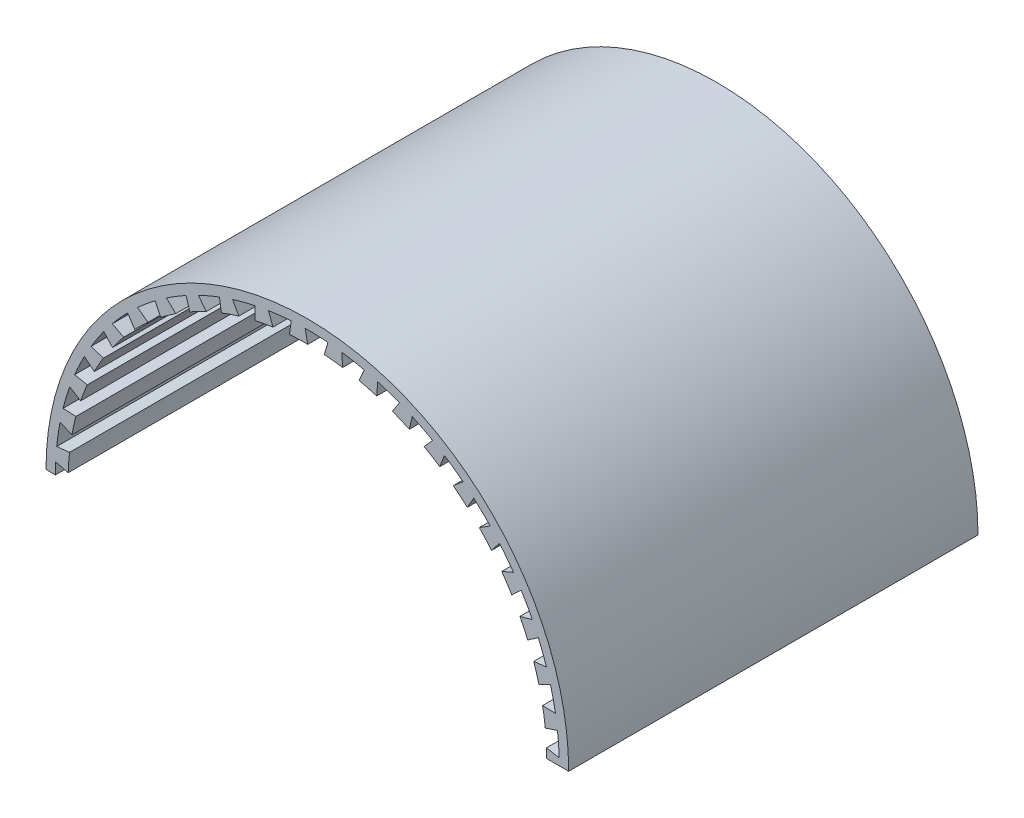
from build123d import *

# Parameters (mm, degrees)
BASE_EXTRUSION_DEPTH         = 65
R_P_TITION_CIRCULAIRE1_COUNT = 43
ESQUISSE2_W                  = 200
ESQUISSE2_H                  = 200
ENL_V_MAT_EXTRU_1_DEPTH      = 105


with BuildPart() as part:
    # Esquisse1 → Base-Extrusion (new body)
    with BuildSketch(Plane.XY):
        with BuildLine():
            Line((35.000842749, 14.79665526), (36.672664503, 15.972341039))
            ThreePointArc((36.672664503, 15.972341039), (37.360644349, 14.289235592), (37.971424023, 12.576603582))
            Line((37.971424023, 12.576603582), (39.395352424, 13.048226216))
            ThreePointArc((39.395352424, 13.048226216), (38.33779742, 15.889093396), (37.07569368, 18.645185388))
            Line((37.07569368, 18.645185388), (35.735608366, 17.971263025))
            Line((35.735608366, 17.971263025), (33.762501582, 17.43827649))
            ThreePointArc((33.762501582, 17.43827649), (34.407033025, 16.129354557), (35.000842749, 14.79665526))
        make_face()
    base_extrusion = extrude(amount=-BASE_EXTRUSION_DEPTH)

    # R_p_tition circulaire1: Base-Extrusion ×43 about axis
    r_p_tition_circulaire1_axis = Axis((0, 0, 0), (0, 0, 1))
    for i in range(1, R_P_TITION_CIRCULAIRE1_COUNT):
        add(base_extrusion.rotate(r_p_tition_circulaire1_axis, i * 360 / R_P_TITION_CIRCULAIRE1_COUNT))

    # Esquisse2 → Enl_v. mat.-Extru.1 (cut)
    with BuildSketch(Plane.XZ):
        with Locations((-10, -40)):
            Rectangle(ESQUISSE2_W, ESQUISSE2_H)
    extrude(amount=ENL_V_MAT_EXTRU_1_DEPTH, mode=Mode.SUBTRACT)


solid = part.part
